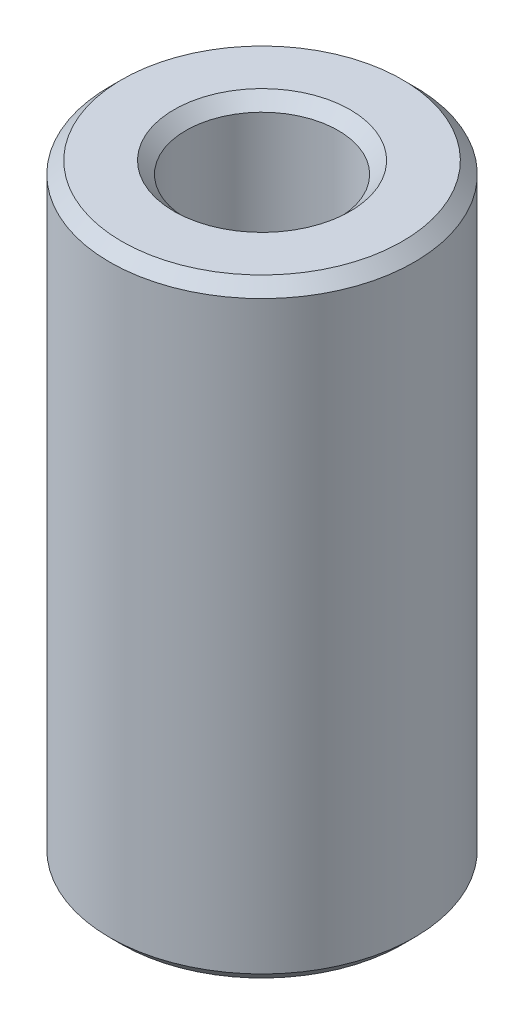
ISO-10303-21;
HEADER;
FILE_DESCRIPTION(('STEP AP214'),'2;1');
FILE_NAME('part.step','',(''),(''),'','','');
FILE_SCHEMA(('AUTOMOTIVE_DESIGN { 1 0 10303 214 1 1 1 1 }'));
ENDSEC;
DATA;
#1=APPLICATION_CONTEXT('core data for automotive mechanical design processes');
#2=APPLICATION_PROTOCOL_DEFINITION('international standard','automotive_design',2000,#1);
#3=PRODUCT_CONTEXT('',#1,'mechanical');
#4=PRODUCT('Part','Part','',(#3));
#5=PRODUCT_RELATED_PRODUCT_CATEGORY('part','',(#4));
#6=PRODUCT_DEFINITION_FORMATION('','',#4);
#7=PRODUCT_DEFINITION_CONTEXT('part definition',#1,'design');
#8=PRODUCT_DEFINITION('design','',#6,#7);
#9=PRODUCT_DEFINITION_SHAPE('','',#8);
#10=(LENGTH_UNIT() NAMED_UNIT(*) SI_UNIT(.MILLI.,.METRE.));
#11=(NAMED_UNIT(*) PLANE_ANGLE_UNIT() SI_UNIT($,.RADIAN.));
#12=(NAMED_UNIT(*) SI_UNIT($,.STERADIAN.) SOLID_ANGLE_UNIT());
#13=UNCERTAINTY_MEASURE_WITH_UNIT(LENGTH_MEASURE(1.E-05),#10,'distance_accuracy_value','');
#14=(GEOMETRIC_REPRESENTATION_CONTEXT(3) GLOBAL_UNCERTAINTY_ASSIGNED_CONTEXT((#13)) GLOBAL_UNIT_ASSIGNED_CONTEXT((#10,
#11,#12)) REPRESENTATION_CONTEXT('',''));
#15=CARTESIAN_POINT('',(0.,0.,0.));
#16=DIRECTION('',(0.,0.,1.));
#17=DIRECTION('',(1.,0.,0.));
#18=AXIS2_PLACEMENT_3D('',#15,#16,#17);
#19=CARTESIAN_POINT('',(0.,25.4,0.));
#20=DIRECTION('',(0.,1.,0.));
#21=DIRECTION('',(0.,0.,1.));
#22=AXIS2_PLACEMENT_3D('',#19,#20,#21);
#23=PLANE('',#22);
#24=CARTESIAN_POINT('',(0.,25.4,0.));
#25=DIRECTION('',(0.,1.,0.));
#26=DIRECTION('',(0.,0.,1.));
#27=AXIS2_PLACEMENT_3D('',#24,#25,#26);
#28=CIRCLE('',#27,5.85);
#29=CARTESIAN_POINT('',(0.,25.4,5.85));
#30=VERTEX_POINT('',#29);
#31=EDGE_CURVE('E10',#30,#30,#28,.T.);
#32=ORIENTED_EDGE('',*,*,#31,.T.);
#33=EDGE_LOOP('',(#32));
#34=FACE_BOUND('',#33,.T.);
#35=CARTESIAN_POINT('',(0.,25.4,0.));
#36=DIRECTION('',(0.,1.,0.));
#37=DIRECTION('',(0.,0.,1.));
#38=AXIS2_PLACEMENT_3D('',#35,#36,#37);
#39=CIRCLE('',#38,3.67500000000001);
#40=CARTESIAN_POINT('',(0.,25.4,3.67500000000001));
#41=VERTEX_POINT('',#40);
#42=EDGE_CURVE('E54',#41,#41,#39,.F.);
#43=ORIENTED_EDGE('',*,*,#42,.T.);
#44=EDGE_LOOP('',(#43));
#45=FACE_BOUND('',#44,.T.);
#46=ADVANCED_FACE('F45',(#34,#45),#23,.T.);
#47=CARTESIAN_POINT('',(0.,0.,0.));
#48=DIRECTION('',(0.,1.,0.));
#49=DIRECTION('',(0.,0.,1.));
#50=AXIS2_PLACEMENT_3D('',#47,#48,#49);
#51=PLANE('',#50);
#52=CARTESIAN_POINT('',(0.,0.,0.));
#53=DIRECTION('',(0.,1.,0.));
#54=DIRECTION('',(0.,0.,1.));
#55=AXIS2_PLACEMENT_3D('',#52,#53,#54);
#56=CIRCLE('',#55,5.85);
#57=CARTESIAN_POINT('',(0.,0.,5.85));
#58=VERTEX_POINT('',#57);
#59=EDGE_CURVE('E70',#58,#58,#56,.F.);
#60=ORIENTED_EDGE('',*,*,#59,.T.);
#61=EDGE_LOOP('',(#60));
#62=FACE_BOUND('',#61,.T.);
#63=CARTESIAN_POINT('',(0.,0.,0.));
#64=DIRECTION('',(0.,1.,0.));
#65=DIRECTION('',(0.,0.,1.));
#66=AXIS2_PLACEMENT_3D('',#63,#64,#65);
#67=CIRCLE('',#66,3.67499999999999);
#68=CARTESIAN_POINT('',(0.,0.,3.67499999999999));
#69=VERTEX_POINT('',#68);
#70=EDGE_CURVE('E74',#69,#69,#67,.T.);
#71=ORIENTED_EDGE('',*,*,#70,.T.);
#72=EDGE_LOOP('',(#71));
#73=FACE_BOUND('',#72,.T.);
#74=ADVANCED_FACE('F103',(#62,#73),#51,.F.);
#75=CARTESIAN_POINT('',(0.,25.4,0.));
#76=DIRECTION('',(0.,-1.,0.));
#77=DIRECTION('',(0.,0.,-1.));
#78=AXIS2_PLACEMENT_3D('',#75,#76,#77);
#79=CYLINDRICAL_SURFACE('',#78,6.35);
#80=CARTESIAN_POINT('',(0.,0.5,0.));
#81=DIRECTION('',(0.,1.,0.));
#82=DIRECTION('',(0.,0.,1.));
#83=AXIS2_PLACEMENT_3D('',#80,#81,#82);
#84=CIRCLE('',#83,6.35);
#85=CARTESIAN_POINT('',(0.,0.5,6.35));
#86=VERTEX_POINT('',#85);
#87=EDGE_CURVE('E78',#86,#86,#84,.T.);
#88=ORIENTED_EDGE('',*,*,#87,.T.);
#89=EDGE_LOOP('',(#88));
#90=FACE_BOUND('',#89,.T.);
#91=CARTESIAN_POINT('',(0.,24.9,0.));
#92=DIRECTION('',(0.,1.,0.));
#93=DIRECTION('',(0.,0.,1.));
#94=AXIS2_PLACEMENT_3D('',#91,#92,#93);
#95=CIRCLE('',#94,6.35);
#96=CARTESIAN_POINT('',(0.,24.9,6.35));
#97=VERTEX_POINT('',#96);
#98=EDGE_CURVE('E82',#97,#97,#95,.F.);
#99=ORIENTED_EDGE('',*,*,#98,.T.);
#100=EDGE_LOOP('',(#99));
#101=FACE_BOUND('',#100,.T.);
#102=ADVANCED_FACE('F87',(#90,#101),#79,.T.);
#103=CARTESIAN_POINT('',(0.,25.4,0.));
#104=DIRECTION('',(0.,-1.,0.));
#105=DIRECTION('',(0.,0.,-1.));
#106=AXIS2_PLACEMENT_3D('',#103,#104,#105);
#107=CYLINDRICAL_SURFACE('',#106,3.175);
#108=CARTESIAN_POINT('',(0.,0.499999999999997,0.));
#109=DIRECTION('',(0.,1.,0.));
#110=DIRECTION('',(0.,0.,1.));
#111=AXIS2_PLACEMENT_3D('',#108,#109,#110);
#112=CIRCLE('',#111,3.175);
#113=CARTESIAN_POINT('',(0.,0.499999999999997,3.175));
#114=VERTEX_POINT('',#113);
#115=EDGE_CURVE('E59',#114,#114,#112,.F.);
#116=ORIENTED_EDGE('',*,*,#115,.T.);
#117=EDGE_LOOP('',(#116));
#118=FACE_BOUND('',#117,.T.);
#119=CARTESIAN_POINT('',(0.,24.9,0.));
#120=DIRECTION('',(0.,1.,0.));
#121=DIRECTION('',(0.,0.,1.));
#122=AXIS2_PLACEMENT_3D('',#119,#120,#121);
#123=CIRCLE('',#122,3.175);
#124=CARTESIAN_POINT('',(0.,24.9,3.175));
#125=VERTEX_POINT('',#124);
#126=EDGE_CURVE('E64',#125,#125,#123,.T.);
#127=ORIENTED_EDGE('',*,*,#126,.T.);
#128=EDGE_LOOP('',(#127));
#129=FACE_BOUND('',#128,.T.);
#130=ADVANCED_FACE('F111',(#118,#129),#107,.F.);
#131=CARTESIAN_POINT('',(0.,0.5,0.));
#132=DIRECTION('',(0.,1.,0.));
#133=DIRECTION('',(0.,0.,1.));
#134=AXIS2_PLACEMENT_3D('',#131,#132,#133);
#135=CONICAL_SURFACE('',#134,6.35,0.785398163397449);
#136=ORIENTED_EDGE('',*,*,#59,.F.);
#137=EDGE_LOOP('',(#136));
#138=FACE_BOUND('',#137,.T.);
#139=ORIENTED_EDGE('',*,*,#87,.F.);
#140=EDGE_LOOP('',(#139));
#141=FACE_BOUND('',#140,.T.);
#142=ADVANCED_FACE('F98',(#138,#141),#135,.T.);
#143=CARTESIAN_POINT('',(0.,0.,0.));
#144=DIRECTION('',(0.,-1.,0.));
#145=DIRECTION('',(0.,0.,-1.));
#146=AXIS2_PLACEMENT_3D('',#143,#144,#145);
#147=CONICAL_SURFACE('',#146,3.67499999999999,0.785398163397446);
#148=ORIENTED_EDGE('',*,*,#115,.F.);
#149=EDGE_LOOP('',(#148));
#150=FACE_BOUND('',#149,.T.);
#151=ORIENTED_EDGE('',*,*,#70,.F.);
#152=EDGE_LOOP('',(#151));
#153=FACE_BOUND('',#152,.T.);
#154=ADVANCED_FACE('F92',(#150,#153),#147,.F.);
#155=CARTESIAN_POINT('',(0.,25.4,0.));
#156=DIRECTION('',(0.,-1.,0.));
#157=DIRECTION('',(0.,0.,-1.));
#158=AXIS2_PLACEMENT_3D('',#155,#156,#157);
#159=CONICAL_SURFACE('',#158,5.85,0.785398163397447);
#160=ORIENTED_EDGE('',*,*,#98,.F.);
#161=EDGE_LOOP('',(#160));
#162=FACE_BOUND('',#161,.T.);
#163=ORIENTED_EDGE('',*,*,#31,.F.);
#164=EDGE_LOOP('',(#163));
#165=FACE_BOUND('',#164,.T.);
#166=ADVANCED_FACE('F89',(#162,#165),#159,.T.);
#167=CARTESIAN_POINT('',(0.,24.9,0.));
#168=DIRECTION('',(0.,1.,0.));
#169=DIRECTION('',(0.,0.,1.));
#170=AXIS2_PLACEMENT_3D('',#167,#168,#169);
#171=CONICAL_SURFACE('',#170,3.175,0.785398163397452);
#172=ORIENTED_EDGE('',*,*,#42,.F.);
#173=EDGE_LOOP('',(#172));
#174=FACE_BOUND('',#173,.T.);
#175=ORIENTED_EDGE('',*,*,#126,.F.);
#176=EDGE_LOOP('',(#175));
#177=FACE_BOUND('',#176,.T.);
#178=ADVANCED_FACE('F48',(#174,#177),#171,.F.);
#179=CLOSED_SHELL('',(#46,#74,#102,#130,#142,#154,#166,#178));
#180=MANIFOLD_SOLID_BREP('B2',#179);
#181=ADVANCED_BREP_SHAPE_REPRESENTATION('',(#18,#180),#14);
#182=SHAPE_DEFINITION_REPRESENTATION(#9,#181);
ENDSEC;
END-ISO-10303-21;
